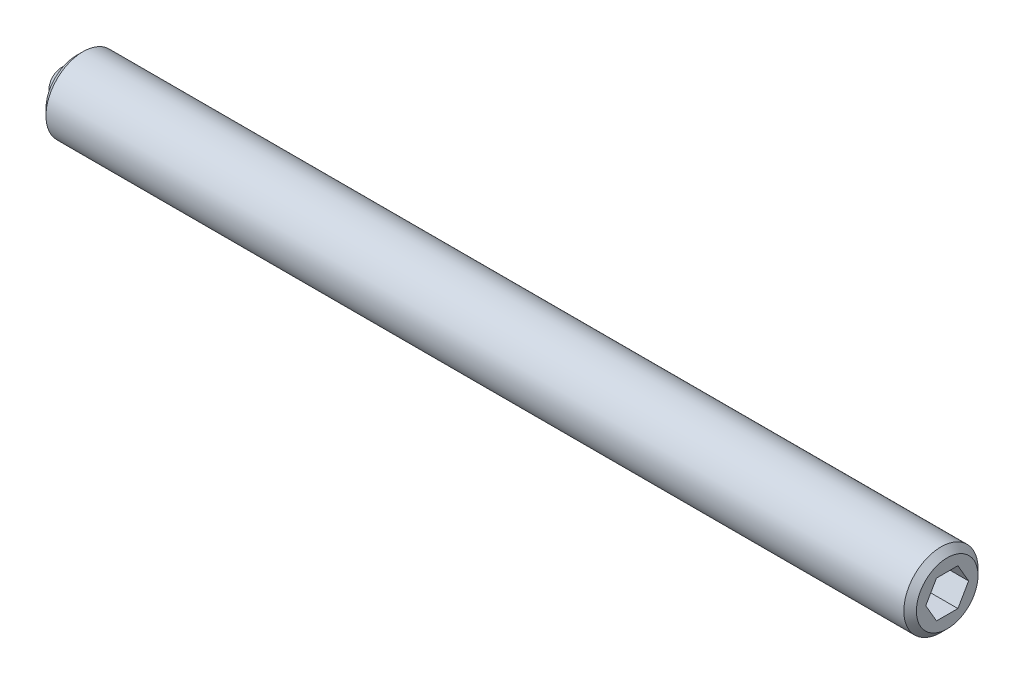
from build123d import *

# Parameters (mm, degrees)
SKETCH2_R           = 1.5
BOSS_EXTRUDE1_DEPTH = 35.2
CHAMFER1_SIZE       = 0.254
CHAMFER2_SIZE       = 0.254
CUT_EXTRUDE2_DEPTH  = 2
SKETCH3_R           = 0.8
CUT_EXTRUDE3_DEPTH  = 0.8


with BuildPart() as part:
    # Sketch2 → Boss-Extrude1 (new body)
    with BuildSketch(Plane(origin=(0, 0, 0), x_dir=(0, 0, -1), z_dir=(1, 0, 0))):
        Circle(SKETCH2_R)
    extrude(amount=BOSS_EXTRUDE1_DEPTH)

    # Chamfer1
    chamfer1_edges = [part.edges().sort_by_distance(p)[0] for p in [
        (0, 0, 1.5),
    ]]
    chamfer(chamfer1_edges, length=CHAMFER1_SIZE)

    # Chamfer2
    chamfer2_edges = [part.edges().sort_by_distance(p)[0] for p in [
        (35.2, 0, 1.5),
    ]]
    chamfer(chamfer2_edges, length=CHAMFER2_SIZE)

    # Sketch4 → Cut-Extrude2 (cut)
    with BuildSketch(Plane(origin=(35.2, 0, 0), x_dir=(0, 0, -1), z_dir=(1, 0, 0))):
        Polygon((0.866025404, 0), (0.433012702, 0.75), (-0.433012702, 0.75), (-0.866025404, 0), (-0.433012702, -0.75), (0.433012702, -0.75), align=None)
    extrude(amount=-CUT_EXTRUDE2_DEPTH, mode=Mode.SUBTRACT)

    # Sketch3 → Cut-Extrude3 (cut)
    with BuildSketch(Plane.ZY):
        Circle(SKETCH3_R)
    extrude(amount=-CUT_EXTRUDE3_DEPTH, mode=Mode.SUBTRACT)


with BuildPart() as body_2:
    # Sketch5 → Revolve1 (revolve)
    with BuildSketch(Plane.ZY):
        with BuildLine():
            Line((0, 0), (0, -0.8))
            ThreePointArc((0, -0.8), (-0.8, 0), (0, 0.8))
            Line((0, 0.8), (0, 0))
        make_face()
    revolve(axis=Axis((0, 0, 0), (0, 1, 0)))


solid = Compound([part.part, body_2.part])
